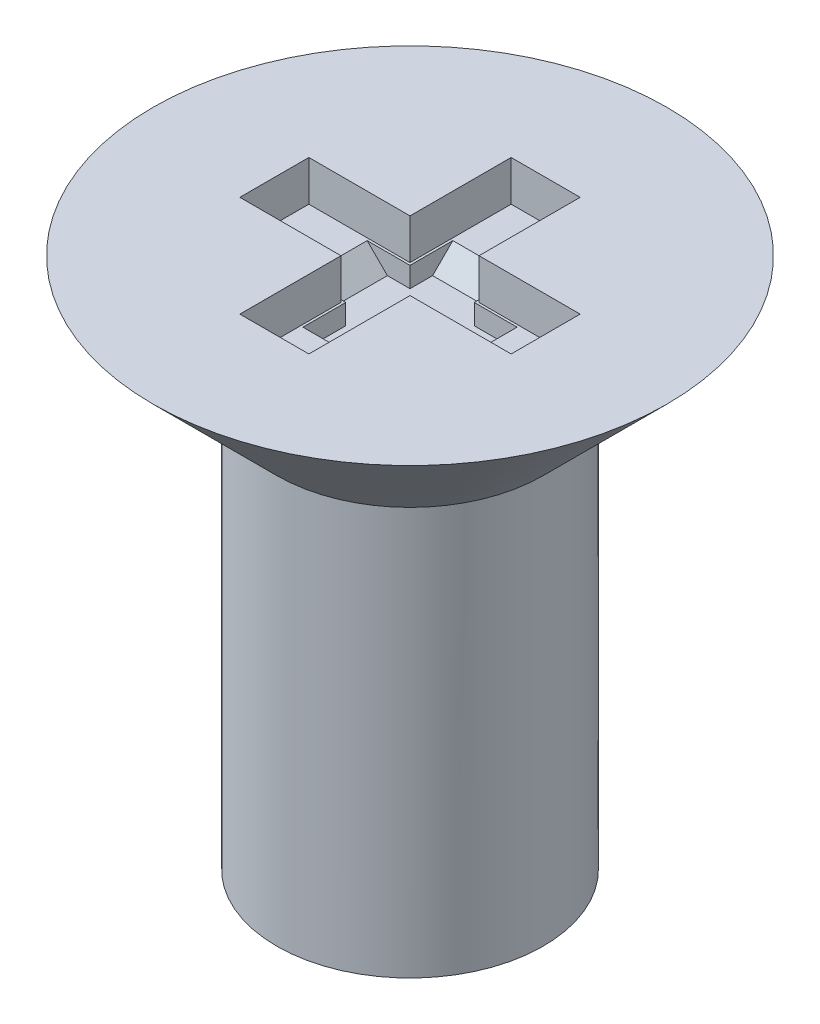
ISO-10303-21;
HEADER;
FILE_DESCRIPTION(('STEP AP214'),'2;1');
FILE_NAME('part.step','',(''),(''),'','','');
FILE_SCHEMA(('AUTOMOTIVE_DESIGN { 1 0 10303 214 1 1 1 1 }'));
ENDSEC;
DATA;
#1=APPLICATION_CONTEXT('core data for automotive mechanical design processes');
#2=APPLICATION_PROTOCOL_DEFINITION('international standard','automotive_design',2000,#1);
#3=PRODUCT_CONTEXT('',#1,'mechanical');
#4=PRODUCT('Part','Part','',(#3));
#5=PRODUCT_RELATED_PRODUCT_CATEGORY('part','',(#4));
#6=PRODUCT_DEFINITION_FORMATION('','',#4);
#7=PRODUCT_DEFINITION_CONTEXT('part definition',#1,'design');
#8=PRODUCT_DEFINITION('design','',#6,#7);
#9=PRODUCT_DEFINITION_SHAPE('','',#8);
#10=(LENGTH_UNIT() NAMED_UNIT(*) SI_UNIT(.MILLI.,.METRE.));
#11=(NAMED_UNIT(*) PLANE_ANGLE_UNIT() SI_UNIT($,.RADIAN.));
#12=(NAMED_UNIT(*) SI_UNIT($,.STERADIAN.) SOLID_ANGLE_UNIT());
#13=UNCERTAINTY_MEASURE_WITH_UNIT(LENGTH_MEASURE(1.E-05),#10,'distance_accuracy_value','');
#14=(GEOMETRIC_REPRESENTATION_CONTEXT(3) GLOBAL_UNCERTAINTY_ASSIGNED_CONTEXT((#13)) GLOBAL_UNIT_ASSIGNED_CONTEXT((#10,
#11,#12)) REPRESENTATION_CONTEXT('',''));
#15=CARTESIAN_POINT('',(0.,0.,0.));
#16=DIRECTION('',(0.,0.,1.));
#17=DIRECTION('',(1.,0.,0.));
#18=AXIS2_PLACEMENT_3D('',#15,#16,#17);
#19=CARTESIAN_POINT('',(-0.58416716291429,0.67306716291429,-0.3429));
#20=DIRECTION('',(0.,-1.,0.));
#21=DIRECTION('',(0.,0.,-1.));
#22=AXIS2_PLACEMENT_3D('',#19,#20,#21);
#23=PLANE('',#22);
#24=DIRECTION('',(1.,0.,0.));
#25=VECTOR('',#24,1.);
#26=CARTESIAN_POINT('',(-0.58416716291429,0.67306716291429,0.3429));
#27=LINE('',#26,#25);
#28=CARTESIAN_POINT('',(-0.58416716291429,0.67306716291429,0.3429));
#29=VERTEX_POINT('',#28);
#30=CARTESIAN_POINT('',(-0.3429,0.67306716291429,0.3429));
#31=VERTEX_POINT('',#30);
#32=EDGE_CURVE('E181',#29,#31,#27,.T.);
#33=ORIENTED_EDGE('',*,*,#32,.T.);
#34=DIRECTION('',(0.,0.,-1.));
#35=VECTOR('',#34,1.);
#36=CARTESIAN_POINT('',(-0.3429,0.67306716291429,0.));
#37=LINE('',#36,#35);
#38=CARTESIAN_POINT('',(-0.3429,0.67306716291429,0.58416716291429));
#39=VERTEX_POINT('',#38);
#40=EDGE_CURVE('E19',#39,#31,#37,.T.);
#41=ORIENTED_EDGE('',*,*,#40,.F.);
#42=DIRECTION('',(1.,0.,0.));
#43=VECTOR('',#42,1.);
#44=CARTESIAN_POINT('',(-0.3429,0.67306716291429,0.58416716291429));
#45=LINE('',#44,#43);
#46=CARTESIAN_POINT('',(0.3429,0.67306716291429,0.58416716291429));
#47=VERTEX_POINT('',#46);
#48=EDGE_CURVE('E178',#39,#47,#45,.T.);
#49=ORIENTED_EDGE('',*,*,#48,.T.);
#50=DIRECTION('',(0.,0.,-1.));
#51=VECTOR('',#50,1.);
#52=CARTESIAN_POINT('',(0.3429,0.67306716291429,-0.3429));
#53=LINE('',#52,#51);
#54=CARTESIAN_POINT('',(0.3429,0.67306716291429,0.3429));
#55=VERTEX_POINT('',#54);
#56=EDGE_CURVE('E193',#47,#55,#53,.T.);
#57=ORIENTED_EDGE('',*,*,#56,.T.);
#58=DIRECTION('',(1.,0.,0.));
#59=VECTOR('',#58,1.);
#60=CARTESIAN_POINT('',(-0.58416716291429,0.67306716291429,0.3429));
#61=LINE('',#60,#59);
#62=CARTESIAN_POINT('',(0.58416716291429,0.67306716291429,0.3429));
#63=VERTEX_POINT('',#62);
#64=EDGE_CURVE('E205',#55,#63,#61,.T.);
#65=ORIENTED_EDGE('',*,*,#64,.T.);
#66=DIRECTION('',(0.,0.,1.));
#67=VECTOR('',#66,1.);
#68=CARTESIAN_POINT('',(0.58416716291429,0.67306716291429,-0.3429));
#69=LINE('',#68,#67);
#70=CARTESIAN_POINT('',(0.58416716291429,0.67306716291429,-0.3429));
#71=VERTEX_POINT('',#70);
#72=EDGE_CURVE('E208',#63,#71,#69,.F.);
#73=ORIENTED_EDGE('',*,*,#72,.T.);
#74=DIRECTION('',(1.,0.,0.));
#75=VECTOR('',#74,1.);
#76=CARTESIAN_POINT('',(0.,0.67306716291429,-0.3429));
#77=LINE('',#76,#75);
#78=CARTESIAN_POINT('',(0.3429,0.67306716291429,-0.3429));
#79=VERTEX_POINT('',#78);
#80=EDGE_CURVE('E209',#79,#71,#77,.T.);
#81=ORIENTED_EDGE('',*,*,#80,.F.);
#82=DIRECTION('',(0.,0.,-1.));
#83=VECTOR('',#82,1.);
#84=CARTESIAN_POINT('',(0.3429,0.67306716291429,-0.3429));
#85=LINE('',#84,#83);
#86=CARTESIAN_POINT('',(0.3429,0.67306716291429,-0.58416716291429));
#87=VERTEX_POINT('',#86);
#88=EDGE_CURVE('E214',#79,#87,#85,.T.);
#89=ORIENTED_EDGE('',*,*,#88,.T.);
#90=DIRECTION('',(-1.,0.,0.));
#91=VECTOR('',#90,1.);
#92=CARTESIAN_POINT('',(-0.3429,0.67306716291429,-0.58416716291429));
#93=LINE('',#92,#91);
#94=CARTESIAN_POINT('',(-0.3429,0.67306716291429,-0.58416716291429));
#95=VERTEX_POINT('',#94);
#96=EDGE_CURVE('E216',#87,#95,#93,.T.);
#97=ORIENTED_EDGE('',*,*,#96,.T.);
#98=DIRECTION('',(0.,0.,-1.));
#99=VECTOR('',#98,1.);
#100=CARTESIAN_POINT('',(-0.3429,0.67306716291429,0.));
#101=LINE('',#100,#99);
#102=CARTESIAN_POINT('',(-0.3429,0.67306716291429,-0.3429));
#103=VERTEX_POINT('',#102);
#104=EDGE_CURVE('E222',#103,#95,#101,.T.);
#105=ORIENTED_EDGE('',*,*,#104,.F.);
#106=DIRECTION('',(1.,0.,0.));
#107=VECTOR('',#106,1.);
#108=CARTESIAN_POINT('',(0.,0.67306716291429,-0.3429));
#109=LINE('',#108,#107);
#110=CARTESIAN_POINT('',(-0.58416716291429,0.67306716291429,-0.3429));
#111=VERTEX_POINT('',#110);
#112=EDGE_CURVE('E224',#111,#103,#109,.T.);
#113=ORIENTED_EDGE('',*,*,#112,.F.);
#114=DIRECTION('',(0.,0.,1.));
#115=VECTOR('',#114,1.);
#116=CARTESIAN_POINT('',(-0.58416716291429,0.67306716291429,-0.3429));
#117=LINE('',#116,#115);
#118=EDGE_CURVE('E227',#111,#29,#117,.T.);
#119=ORIENTED_EDGE('',*,*,#118,.T.);
#120=EDGE_LOOP('',(#33,#41,#49,#57,#65,#73,#81,#89,#97,#105,#113,#119));
#121=FACE_BOUND('',#120,.T.);
#122=ADVANCED_FACE('F16',(#121),#23,.F.);
#123=CARTESIAN_POINT('',(0.,-4.350004,0.));
#124=DIRECTION('',(0.,1.,0.));
#125=DIRECTION('',(0.,0.,1.));
#126=AXIS2_PLACEMENT_3D('',#123,#124,#125);
#127=PLANE('',#126);
#128=CARTESIAN_POINT('',(0.,-4.350004,0.));
#129=DIRECTION('',(0.,1.,0.));
#130=DIRECTION('',(0.,0.,1.));
#131=AXIS2_PLACEMENT_3D('',#128,#129,#130);
#132=CIRCLE('',#131,1.4224);
#133=CARTESIAN_POINT('',(0.,-4.350004,1.4224));
#134=VERTEX_POINT('',#133);
#135=EDGE_CURVE('E199',#134,#134,#132,.T.);
#136=ORIENTED_EDGE('',*,*,#135,.F.);
#137=EDGE_LOOP('',(#136));
#138=FACE_BOUND('',#137,.T.);
#139=ADVANCED_FACE('F552',(#138),#127,.F.);
#140=CARTESIAN_POINT('',(-0.3429,0.,0.));
#141=DIRECTION('',(1.,0.,0.));
#142=DIRECTION('',(0.,0.,-1.));
#143=AXIS2_PLACEMENT_3D('',#140,#141,#142);
#144=PLANE('',#143);
#145=ORIENTED_EDGE('',*,*,#40,.T.);
#146=DIRECTION('',(0.,1.,0.));
#147=VECTOR('',#146,1.);
#148=CARTESIAN_POINT('',(-0.3429,0.,0.3429));
#149=LINE('',#148,#147);
#150=CARTESIAN_POINT('',(-0.3429,0.889,0.3429));
#151=VERTEX_POINT('',#150);
#152=EDGE_CURVE('E184',#31,#151,#149,.T.);
#153=ORIENTED_EDGE('',*,*,#152,.T.);
#154=DIRECTION('',(0.,0.,1.));
#155=VECTOR('',#154,1.);
#156=CARTESIAN_POINT('',(-0.3429,0.889,0.));
#157=LINE('',#156,#155);
#158=CARTESIAN_POINT('',(-0.3429,0.889,0.8001));
#159=VERTEX_POINT('',#158);
#160=EDGE_CURVE('E189',#159,#151,#157,.F.);
#161=ORIENTED_EDGE('',*,*,#160,.F.);
#162=DIRECTION('',(0.,-0.707106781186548,-0.707106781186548));
#163=VECTOR('',#162,1.);
#164=CARTESIAN_POINT('',(-0.3429,0.889,0.8001));
#165=LINE('',#164,#163);
#166=EDGE_CURVE('E186',#159,#39,#165,.T.);
#167=ORIENTED_EDGE('',*,*,#166,.T.);
#168=EDGE_LOOP('',(#145,#153,#161,#167));
#169=FACE_BOUND('',#168,.T.);
#170=ADVANCED_FACE('F187',(#169),#144,.T.);
#171=CARTESIAN_POINT('',(0.,0.,0.3429));
#172=DIRECTION('',(0.,0.,1.));
#173=DIRECTION('',(1.,0.,0.));
#174=AXIS2_PLACEMENT_3D('',#171,#172,#173);
#175=PLANE('',#174);
#176=DIRECTION('',(0.707106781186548,-0.707106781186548,0.));
#177=VECTOR('',#176,1.);
#178=CARTESIAN_POINT('',(-1.2319,1.3208,0.3429));
#179=LINE('',#178,#177);
#180=CARTESIAN_POINT('',(-0.8001,0.889,0.3429));
#181=VERTEX_POINT('',#180);
#182=EDGE_CURVE('E228',#29,#181,#179,.F.);
#183=ORIENTED_EDGE('',*,*,#182,.T.);
#184=DIRECTION('',(1.,0.,0.));
#185=VECTOR('',#184,1.);
#186=CARTESIAN_POINT('',(0.,0.889,0.3429));
#187=LINE('',#186,#185);
#188=EDGE_CURVE('E237',#151,#181,#187,.F.);
#189=ORIENTED_EDGE('',*,*,#188,.F.);
#190=ORIENTED_EDGE('',*,*,#152,.F.);
#191=ORIENTED_EDGE('',*,*,#32,.F.);
#192=EDGE_LOOP('',(#183,#189,#190,#191));
#193=FACE_BOUND('',#192,.T.);
#194=ADVANCED_FACE('F547',(#193),#175,.F.);
#195=CARTESIAN_POINT('',(-1.2319,1.3208,-0.3429));
#196=DIRECTION('',(-0.707106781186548,-0.707106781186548,0.));
#197=DIRECTION('',(0.707106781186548,-0.707106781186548,0.));
#198=AXIS2_PLACEMENT_3D('',#195,#196,#197);
#199=PLANE('',#198);
#200=ORIENTED_EDGE('',*,*,#182,.F.);
#201=ORIENTED_EDGE('',*,*,#118,.F.);
#202=DIRECTION('',(0.707106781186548,-0.707106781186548,0.));
#203=VECTOR('',#202,1.);
#204=CARTESIAN_POINT('',(-0.8001,0.889,-0.3429));
#205=LINE('',#204,#203);
#206=CARTESIAN_POINT('',(-0.8001,0.889,-0.3429));
#207=VERTEX_POINT('',#206);
#208=EDGE_CURVE('E226',#207,#111,#205,.T.);
#209=ORIENTED_EDGE('',*,*,#208,.F.);
#210=DIRECTION('',(0.,0.,1.));
#211=VECTOR('',#210,1.);
#212=CARTESIAN_POINT('',(-0.8001,0.889,0.));
#213=LINE('',#212,#211);
#214=EDGE_CURVE('E240',#181,#207,#213,.F.);
#215=ORIENTED_EDGE('',*,*,#214,.F.);
#216=EDGE_LOOP('',(#200,#201,#209,#215));
#217=FACE_BOUND('',#216,.T.);
#218=ADVANCED_FACE('F314',(#217),#199,.F.);
#219=CARTESIAN_POINT('',(0.,0.,-0.3429));
#220=DIRECTION('',(0.,0.,1.));
#221=DIRECTION('',(1.,0.,0.));
#222=AXIS2_PLACEMENT_3D('',#219,#220,#221);
#223=PLANE('',#222);
#224=ORIENTED_EDGE('',*,*,#112,.T.);
#225=DIRECTION('',(0.,1.,0.));
#226=VECTOR('',#225,1.);
#227=CARTESIAN_POINT('',(-0.3429,0.,-0.3429));
#228=LINE('',#227,#226);
#229=CARTESIAN_POINT('',(-0.3429,0.889,-0.3429));
#230=VERTEX_POINT('',#229);
#231=EDGE_CURVE('E221',#230,#103,#228,.F.);
#232=ORIENTED_EDGE('',*,*,#231,.F.);
#233=DIRECTION('',(1.,0.,0.));
#234=VECTOR('',#233,1.);
#235=CARTESIAN_POINT('',(0.,0.889,-0.3429));
#236=LINE('',#235,#234);
#237=EDGE_CURVE('E294',#207,#230,#236,.T.);
#238=ORIENTED_EDGE('',*,*,#237,.F.);
#239=ORIENTED_EDGE('',*,*,#208,.T.);
#240=EDGE_LOOP('',(#224,#232,#238,#239));
#241=FACE_BOUND('',#240,.T.);
#242=ADVANCED_FACE('F317',(#241),#223,.T.);
#243=CARTESIAN_POINT('',(-0.3429,0.,0.));
#244=DIRECTION('',(1.,0.,0.));
#245=DIRECTION('',(0.,0.,-1.));
#246=AXIS2_PLACEMENT_3D('',#243,#244,#245);
#247=PLANE('',#246);
#248=DIRECTION('',(0.,0.,1.));
#249=VECTOR('',#248,1.);
#250=CARTESIAN_POINT('',(-0.3429,0.889,0.));
#251=LINE('',#250,#249);
#252=CARTESIAN_POINT('',(-0.3429,0.889,-0.8001));
#253=VERTEX_POINT('',#252);
#254=EDGE_CURVE('E291',#230,#253,#251,.F.);
#255=ORIENTED_EDGE('',*,*,#254,.F.);
#256=ORIENTED_EDGE('',*,*,#231,.T.);
#257=ORIENTED_EDGE('',*,*,#104,.T.);
#258=DIRECTION('',(0.,0.707106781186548,-0.707106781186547));
#259=VECTOR('',#258,1.);
#260=CARTESIAN_POINT('',(-0.3429,0.673094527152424,-0.584194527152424));
#261=LINE('',#260,#259);
#262=EDGE_CURVE('E219',#95,#253,#261,.T.);
#263=ORIENTED_EDGE('',*,*,#262,.T.);
#264=EDGE_LOOP('',(#255,#256,#257,#263));
#265=FACE_BOUND('',#264,.T.);
#266=ADVANCED_FACE('F320',(#265),#247,.T.);
#267=CARTESIAN_POINT('',(-0.3429,0.6731,-0.5842));
#268=DIRECTION('',(0.,-0.707106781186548,-0.707106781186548));
#269=DIRECTION('',(0.,0.707106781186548,-0.707106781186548));
#270=AXIS2_PLACEMENT_3D('',#267,#268,#269);
#271=PLANE('',#270);
#272=DIRECTION('',(0.,0.707106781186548,-0.707106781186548));
#273=VECTOR('',#272,1.);
#274=CARTESIAN_POINT('',(0.3429,0.6731,-0.5842));
#275=LINE('',#274,#273);
#276=CARTESIAN_POINT('',(0.3429,0.889,-0.8001));
#277=VERTEX_POINT('',#276);
#278=EDGE_CURVE('E212',#87,#277,#275,.T.);
#279=ORIENTED_EDGE('',*,*,#278,.T.);
#280=DIRECTION('',(1.,0.,0.));
#281=VECTOR('',#280,1.);
#282=CARTESIAN_POINT('',(0.,0.889,-0.8001));
#283=LINE('',#282,#281);
#284=EDGE_CURVE('E288',#253,#277,#283,.T.);
#285=ORIENTED_EDGE('',*,*,#284,.F.);
#286=ORIENTED_EDGE('',*,*,#262,.F.);
#287=ORIENTED_EDGE('',*,*,#96,.F.);
#288=EDGE_LOOP('',(#279,#285,#286,#287));
#289=FACE_BOUND('',#288,.T.);
#290=ADVANCED_FACE('F325',(#289),#271,.F.);
#291=CARTESIAN_POINT('',(0.3429,0.,0.));
#292=DIRECTION('',(1.,0.,0.));
#293=DIRECTION('',(0.,0.,-1.));
#294=AXIS2_PLACEMENT_3D('',#291,#292,#293);
#295=PLANE('',#294);
#296=ORIENTED_EDGE('',*,*,#278,.F.);
#297=ORIENTED_EDGE('',*,*,#88,.F.);
#298=DIRECTION('',(0.,1.,0.));
#299=VECTOR('',#298,1.);
#300=CARTESIAN_POINT('',(0.3429,0.,-0.3429));
#301=LINE('',#300,#299);
#302=CARTESIAN_POINT('',(0.3429,0.889,-0.3429));
#303=VERTEX_POINT('',#302);
#304=EDGE_CURVE('E211',#303,#79,#301,.F.);
#305=ORIENTED_EDGE('',*,*,#304,.F.);
#306=DIRECTION('',(0.,0.,1.));
#307=VECTOR('',#306,1.);
#308=CARTESIAN_POINT('',(0.3429,0.889,0.));
#309=LINE('',#308,#307);
#310=EDGE_CURVE('E281',#277,#303,#309,.T.);
#311=ORIENTED_EDGE('',*,*,#310,.F.);
#312=EDGE_LOOP('',(#296,#297,#305,#311));
#313=FACE_BOUND('',#312,.T.);
#314=ADVANCED_FACE('F330',(#313),#295,.F.);
#315=CARTESIAN_POINT('',(0.,0.,-0.3429));
#316=DIRECTION('',(0.,0.,1.));
#317=DIRECTION('',(1.,0.,0.));
#318=AXIS2_PLACEMENT_3D('',#315,#316,#317);
#319=PLANE('',#318);
#320=DIRECTION('',(1.,0.,0.));
#321=VECTOR('',#320,1.);
#322=CARTESIAN_POINT('',(0.,0.889,-0.3429));
#323=LINE('',#322,#321);
#324=CARTESIAN_POINT('',(0.8001,0.889,-0.3429));
#325=VERTEX_POINT('',#324);
#326=EDGE_CURVE('E276',#303,#325,#323,.T.);
#327=ORIENTED_EDGE('',*,*,#326,.F.);
#328=ORIENTED_EDGE('',*,*,#304,.T.);
#329=ORIENTED_EDGE('',*,*,#80,.T.);
#330=DIRECTION('',(0.707106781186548,0.707106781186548,0.));
#331=VECTOR('',#330,1.);
#332=CARTESIAN_POINT('',(0.58416716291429,0.67306716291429,-0.3429));
#333=LINE('',#332,#331);
#334=EDGE_CURVE('E269',#71,#325,#333,.T.);
#335=ORIENTED_EDGE('',*,*,#334,.T.);
#336=EDGE_LOOP('',(#327,#328,#329,#335));
#337=FACE_BOUND('',#336,.T.);
#338=ADVANCED_FACE('F333',(#337),#319,.T.);
#339=CARTESIAN_POINT('',(0.58416716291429,0.67306716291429,-0.3429));
#340=DIRECTION('',(0.707106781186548,-0.707106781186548,0.));
#341=DIRECTION('',(0.707106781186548,0.707106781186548,0.));
#342=AXIS2_PLACEMENT_3D('',#339,#340,#341);
#343=PLANE('',#342);
#344=DIRECTION('',(0.707106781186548,0.707106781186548,0.));
#345=VECTOR('',#344,1.);
#346=CARTESIAN_POINT('',(0.58416716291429,0.67306716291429,0.3429));
#347=LINE('',#346,#345);
#348=CARTESIAN_POINT('',(0.8001,0.889,0.3429));
#349=VERTEX_POINT('',#348);
#350=EDGE_CURVE('E207',#63,#349,#347,.T.);
#351=ORIENTED_EDGE('',*,*,#350,.T.);
#352=DIRECTION('',(0.,0.,1.));
#353=VECTOR('',#352,1.);
#354=CARTESIAN_POINT('',(0.8001,0.889,0.));
#355=LINE('',#354,#353);
#356=EDGE_CURVE('E264',#325,#349,#355,.T.);
#357=ORIENTED_EDGE('',*,*,#356,.F.);
#358=ORIENTED_EDGE('',*,*,#334,.F.);
#359=ORIENTED_EDGE('',*,*,#72,.F.);
#360=EDGE_LOOP('',(#351,#357,#358,#359));
#361=FACE_BOUND('',#360,.T.);
#362=ADVANCED_FACE('F338',(#361),#343,.F.);
#363=CARTESIAN_POINT('',(0.,0.,0.3429));
#364=DIRECTION('',(0.,0.,1.));
#365=DIRECTION('',(1.,0.,0.));
#366=AXIS2_PLACEMENT_3D('',#363,#364,#365);
#367=PLANE('',#366);
#368=ORIENTED_EDGE('',*,*,#350,.F.);
#369=ORIENTED_EDGE('',*,*,#64,.F.);
#370=DIRECTION('',(0.,1.,0.));
#371=VECTOR('',#370,1.);
#372=CARTESIAN_POINT('',(0.3429,0.,0.3429));
#373=LINE('',#372,#371);
#374=CARTESIAN_POINT('',(0.3429,0.889,0.3429));
#375=VERTEX_POINT('',#374);
#376=EDGE_CURVE('E204',#55,#375,#373,.T.);
#377=ORIENTED_EDGE('',*,*,#376,.T.);
#378=DIRECTION('',(1.,0.,0.));
#379=VECTOR('',#378,1.);
#380=CARTESIAN_POINT('',(0.,0.889,0.3429));
#381=LINE('',#380,#379);
#382=EDGE_CURVE('E260',#349,#375,#381,.F.);
#383=ORIENTED_EDGE('',*,*,#382,.F.);
#384=EDGE_LOOP('',(#368,#369,#377,#383));
#385=FACE_BOUND('',#384,.T.);
#386=ADVANCED_FACE('F342',(#385),#367,.F.);
#387=CARTESIAN_POINT('',(0.3429,0.,0.));
#388=DIRECTION('',(1.,0.,0.));
#389=DIRECTION('',(0.,0.,-1.));
#390=AXIS2_PLACEMENT_3D('',#387,#388,#389);
#391=PLANE('',#390);
#392=DIRECTION('',(0.,0.707106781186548,0.707106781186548));
#393=VECTOR('',#392,1.);
#394=CARTESIAN_POINT('',(0.3429,0.673094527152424,0.584194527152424));
#395=LINE('',#394,#393);
#396=CARTESIAN_POINT('',(0.3429,0.889,0.8001));
#397=VERTEX_POINT('',#396);
#398=EDGE_CURVE('E197',#47,#397,#395,.T.);
#399=ORIENTED_EDGE('',*,*,#398,.T.);
#400=DIRECTION('',(0.,0.,1.));
#401=VECTOR('',#400,1.);
#402=CARTESIAN_POINT('',(0.3429,0.889,0.));
#403=LINE('',#402,#401);
#404=EDGE_CURVE('E263',#375,#397,#403,.T.);
#405=ORIENTED_EDGE('',*,*,#404,.F.);
#406=ORIENTED_EDGE('',*,*,#376,.F.);
#407=ORIENTED_EDGE('',*,*,#56,.F.);
#408=EDGE_LOOP('',(#399,#405,#406,#407));
#409=FACE_BOUND('',#408,.T.);
#410=ADVANCED_FACE('F346',(#409),#391,.F.);
#411=CARTESIAN_POINT('',(-0.3429,1.3208,1.2319));
#412=DIRECTION('',(0.,-0.707106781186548,0.707106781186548));
#413=DIRECTION('',(0.,-0.707106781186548,-0.707106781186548));
#414=AXIS2_PLACEMENT_3D('',#411,#412,#413);
#415=PLANE('',#414);
#416=ORIENTED_EDGE('',*,*,#398,.F.);
#417=ORIENTED_EDGE('',*,*,#48,.F.);
#418=ORIENTED_EDGE('',*,*,#166,.F.);
#419=DIRECTION('',(1.,0.,0.));
#420=VECTOR('',#419,1.);
#421=CARTESIAN_POINT('',(0.,0.889,0.8001));
#422=LINE('',#421,#420);
#423=EDGE_CURVE('E347',#397,#159,#422,.F.);
#424=ORIENTED_EDGE('',*,*,#423,.F.);
#425=EDGE_LOOP('',(#416,#417,#418,#424));
#426=FACE_BOUND('',#425,.T.);
#427=ADVANCED_FACE('F196',(#426),#415,.F.);
#428=CARTESIAN_POINT('',(0.,0.,0.));
#429=DIRECTION('',(0.,1.,0.));
#430=DIRECTION('',(0.,0.,1.));
#431=AXIS2_PLACEMENT_3D('',#428,#429,#430);
#432=CYLINDRICAL_SURFACE('',#431,1.4224);
#433=ORIENTED_EDGE('',*,*,#135,.T.);
#434=EDGE_LOOP('',(#433));
#435=FACE_BOUND('',#434,.T.);
#436=CARTESIAN_POINT('',(0.,0.,0.));
#437=DIRECTION('',(0.,1.,0.));
#438=DIRECTION('',(1.,0.,0.));
#439=AXIS2_PLACEMENT_3D('',#436,#437,#438);
#440=CIRCLE('',#439,1.42239999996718);
#441=CARTESIAN_POINT('',(1.42239999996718,0.,0.));
#442=VERTEX_POINT('',#441);
#443=EDGE_CURVE('E348',#442,#442,#440,.T.);
#444=ORIENTED_EDGE('',*,*,#443,.F.);
#445=EDGE_LOOP('',(#444));
#446=FACE_BOUND('',#445,.T.);
#447=ADVANCED_FACE('F524',(#435,#446),#432,.T.);
#448=CARTESIAN_POINT('',(0.,0.889,0.));
#449=DIRECTION('',(0.,1.,0.));
#450=DIRECTION('',(0.,0.,1.));
#451=AXIS2_PLACEMENT_3D('',#448,#449,#450);
#452=PLANE('',#451);
#453=ORIENTED_EDGE('',*,*,#404,.T.);
#454=ORIENTED_EDGE('',*,*,#423,.T.);
#455=ORIENTED_EDGE('',*,*,#160,.T.);
#456=ORIENTED_EDGE('',*,*,#188,.T.);
#457=ORIENTED_EDGE('',*,*,#214,.T.);
#458=ORIENTED_EDGE('',*,*,#237,.T.);
#459=ORIENTED_EDGE('',*,*,#254,.T.);
#460=ORIENTED_EDGE('',*,*,#284,.T.);
#461=ORIENTED_EDGE('',*,*,#310,.T.);
#462=ORIENTED_EDGE('',*,*,#326,.T.);
#463=ORIENTED_EDGE('',*,*,#356,.T.);
#464=ORIENTED_EDGE('',*,*,#382,.T.);
#465=EDGE_LOOP('',(#453,#454,#455,#456,#457,#458,#459,#460,#461,#462,#463,#464));
#466=FACE_BOUND('',#465,.T.);
#467=DIRECTION('',(-1.,0.,0.));
#468=VECTOR('',#467,1.);
#469=CARTESIAN_POINT('',(0.3683,0.889,-1.4478));
#470=LINE('',#469,#468);
#471=CARTESIAN_POINT('',(0.3683,0.889,-1.4478));
#472=VERTEX_POINT('',#471);
#473=CARTESIAN_POINT('',(-0.3683,0.889,-1.4478));
#474=VERTEX_POINT('',#473);
#475=EDGE_CURVE('E353',#472,#474,#470,.T.);
#476=ORIENTED_EDGE('',*,*,#475,.T.);
#477=DIRECTION('',(0.,0.,1.));
#478=VECTOR('',#477,1.);
#479=CARTESIAN_POINT('',(-0.3683,0.889,-1.4478));
#480=LINE('',#479,#478);
#481=CARTESIAN_POINT('',(-0.3683,0.889,-0.3683));
#482=VERTEX_POINT('',#481);
#483=EDGE_CURVE('E398',#474,#482,#480,.T.);
#484=ORIENTED_EDGE('',*,*,#483,.T.);
#485=DIRECTION('',(-1.,0.,0.));
#486=VECTOR('',#485,1.);
#487=CARTESIAN_POINT('',(-0.3683,0.889,-0.3683));
#488=LINE('',#487,#486);
#489=CARTESIAN_POINT('',(-1.4478,0.889,-0.3683));
#490=VERTEX_POINT('',#489);
#491=EDGE_CURVE('E391',#482,#490,#488,.T.);
#492=ORIENTED_EDGE('',*,*,#491,.T.);
#493=DIRECTION('',(0.,0.,1.));
#494=VECTOR('',#493,1.);
#495=CARTESIAN_POINT('',(-1.4478,0.889,-0.3683));
#496=LINE('',#495,#494);
#497=CARTESIAN_POINT('',(-1.4478,0.889,0.3683));
#498=VERTEX_POINT('',#497);
#499=EDGE_CURVE('E387',#490,#498,#496,.T.);
#500=ORIENTED_EDGE('',*,*,#499,.T.);
#501=DIRECTION('',(1.,0.,0.));
#502=VECTOR('',#501,1.);
#503=CARTESIAN_POINT('',(-1.4478,0.889,0.3683));
#504=LINE('',#503,#502);
#505=CARTESIAN_POINT('',(-0.3683,0.889,0.3683));
#506=VERTEX_POINT('',#505);
#507=EDGE_CURVE('E383',#498,#506,#504,.T.);
#508=ORIENTED_EDGE('',*,*,#507,.T.);
#509=DIRECTION('',(0.,0.,1.));
#510=VECTOR('',#509,1.);
#511=CARTESIAN_POINT('',(-0.3683,0.889,0.3683));
#512=LINE('',#511,#510);
#513=CARTESIAN_POINT('',(-0.3683,0.889,1.4478));
#514=VERTEX_POINT('',#513);
#515=EDGE_CURVE('E379',#506,#514,#512,.T.);
#516=ORIENTED_EDGE('',*,*,#515,.T.);
#517=DIRECTION('',(1.,0.,0.));
#518=VECTOR('',#517,1.);
#519=CARTESIAN_POINT('',(-0.3683,0.889,1.4478));
#520=LINE('',#519,#518);
#521=CARTESIAN_POINT('',(0.3683,0.889,1.4478));
#522=VERTEX_POINT('',#521);
#523=EDGE_CURVE('E375',#514,#522,#520,.T.);
#524=ORIENTED_EDGE('',*,*,#523,.T.);
#525=DIRECTION('',(0.,0.,-1.));
#526=VECTOR('',#525,1.);
#527=CARTESIAN_POINT('',(0.3683,0.889,1.4478));
#528=LINE('',#527,#526);
#529=CARTESIAN_POINT('',(0.3683,0.889,0.3683));
#530=VERTEX_POINT('',#529);
#531=EDGE_CURVE('E371',#522,#530,#528,.T.);
#532=ORIENTED_EDGE('',*,*,#531,.T.);
#533=DIRECTION('',(1.,0.,0.));
#534=VECTOR('',#533,1.);
#535=CARTESIAN_POINT('',(0.3683,0.889,0.3683));
#536=LINE('',#535,#534);
#537=CARTESIAN_POINT('',(1.4478,0.889,0.3683));
#538=VERTEX_POINT('',#537);
#539=EDGE_CURVE('E367',#530,#538,#536,.T.);
#540=ORIENTED_EDGE('',*,*,#539,.T.);
#541=DIRECTION('',(0.,0.,-1.));
#542=VECTOR('',#541,1.);
#543=CARTESIAN_POINT('',(1.4478,0.889,0.3683));
#544=LINE('',#543,#542);
#545=CARTESIAN_POINT('',(1.4478,0.889,-0.3683));
#546=VERTEX_POINT('',#545);
#547=EDGE_CURVE('E363',#538,#546,#544,.T.);
#548=ORIENTED_EDGE('',*,*,#547,.T.);
#549=DIRECTION('',(-1.,0.,0.));
#550=VECTOR('',#549,1.);
#551=CARTESIAN_POINT('',(1.4478,0.889,-0.3683));
#552=LINE('',#551,#550);
#553=CARTESIAN_POINT('',(0.3683,0.889,-0.3683));
#554=VERTEX_POINT('',#553);
#555=EDGE_CURVE('E359',#546,#554,#552,.T.);
#556=ORIENTED_EDGE('',*,*,#555,.T.);
#557=DIRECTION('',(0.,0.,-1.));
#558=VECTOR('',#557,1.);
#559=CARTESIAN_POINT('',(0.3683,0.889,-0.3683));
#560=LINE('',#559,#558);
#561=EDGE_CURVE('E355',#554,#472,#560,.T.);
#562=ORIENTED_EDGE('',*,*,#561,.T.);
#563=EDGE_LOOP('',(#476,#484,#492,#500,#508,#516,#524,#532,#540,#548,#556,#562));
#564=FACE_BOUND('',#563,.T.);
#565=ADVANCED_FACE('F309',(#466,#564),#452,.T.);
#566=CARTESIAN_POINT('',(0.,1.32079999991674,0.));
#567=DIRECTION('',(0.,1.,0.));
#568=DIRECTION('',(0.,0.,1.));
#569=AXIS2_PLACEMENT_3D('',#566,#567,#568);
#570=CONICAL_SURFACE('',#569,2.74319999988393,0.785398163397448);
#571=CARTESIAN_POINT('',(0.,1.32080000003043,0.));
#572=DIRECTION('',(0.,1.,0.));
#573=DIRECTION('',(0.,0.,1.));
#574=AXIS2_PLACEMENT_3D('',#571,#572,#573);
#575=CIRCLE('',#574,2.74319999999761);
#576=CARTESIAN_POINT('',(0.,1.32080000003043,2.74319999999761));
#577=VERTEX_POINT('',#576);
#578=EDGE_CURVE('E243',#577,#577,#575,.T.);
#579=ORIENTED_EDGE('',*,*,#578,.F.);
#580=EDGE_LOOP('',(#579));
#581=FACE_BOUND('',#580,.T.);
#582=ORIENTED_EDGE('',*,*,#443,.T.);
#583=EDGE_LOOP('',(#582));
#584=FACE_BOUND('',#583,.T.);
#585=ADVANCED_FACE('F518',(#581,#584),#570,.T.);
#586=CARTESIAN_POINT('',(0.3683,2.921,-1.4478));
#587=DIRECTION('',(0.,0.,-1.));
#588=DIRECTION('',(-1.,0.,0.));
#589=AXIS2_PLACEMENT_3D('',#586,#587,#588);
#590=PLANE('',#589);
#591=ORIENTED_EDGE('',*,*,#475,.F.);
#592=DIRECTION('',(0.,1.,0.));
#593=VECTOR('',#592,1.);
#594=CARTESIAN_POINT('',(0.3683,2.921,-1.4478));
#595=LINE('',#594,#593);
#596=CARTESIAN_POINT('',(0.3683,1.3208,-1.4478));
#597=VERTEX_POINT('',#596);
#598=EDGE_CURVE('E357',#472,#597,#595,.T.);
#599=ORIENTED_EDGE('',*,*,#598,.T.);
#600=DIRECTION('',(1.,0.,0.));
#601=VECTOR('',#600,1.);
#602=CARTESIAN_POINT('',(0.,1.3208,-1.4478));
#603=LINE('',#602,#601);
#604=CARTESIAN_POINT('',(-0.3683,1.3208,-1.4478));
#605=VERTEX_POINT('',#604);
#606=EDGE_CURVE('E245',#605,#597,#603,.T.);
#607=ORIENTED_EDGE('',*,*,#606,.F.);
#608=DIRECTION('',(0.,1.,0.));
#609=VECTOR('',#608,1.);
#610=CARTESIAN_POINT('',(-0.3683,2.921,-1.4478));
#611=LINE('',#610,#609);
#612=EDGE_CURVE('E395',#605,#474,#611,.F.);
#613=ORIENTED_EDGE('',*,*,#612,.T.);
#614=EDGE_LOOP('',(#591,#599,#607,#613));
#615=FACE_BOUND('',#614,.T.);
#616=ADVANCED_FACE('F483',(#615),#590,.F.);
#617=CARTESIAN_POINT('',(0.3683,2.921,-0.3683));
#618=DIRECTION('',(1.,0.,0.));
#619=DIRECTION('',(0.,0.,-1.));
#620=AXIS2_PLACEMENT_3D('',#617,#618,#619);
#621=PLANE('',#620);
#622=ORIENTED_EDGE('',*,*,#561,.F.);
#623=DIRECTION('',(0.,1.,0.));
#624=VECTOR('',#623,1.);
#625=CARTESIAN_POINT('',(0.3683,2.921,-0.3683));
#626=LINE('',#625,#624);
#627=CARTESIAN_POINT('',(0.3683,1.3208,-0.3683));
#628=VERTEX_POINT('',#627);
#629=EDGE_CURVE('E361',#554,#628,#626,.T.);
#630=ORIENTED_EDGE('',*,*,#629,.T.);
#631=DIRECTION('',(0.,0.,1.));
#632=VECTOR('',#631,1.);
#633=CARTESIAN_POINT('',(0.3683,1.3208,0.));
#634=LINE('',#633,#632);
#635=EDGE_CURVE('E403',#597,#628,#634,.T.);
#636=ORIENTED_EDGE('',*,*,#635,.F.);
#637=ORIENTED_EDGE('',*,*,#598,.F.);
#638=EDGE_LOOP('',(#622,#630,#636,#637));
#639=FACE_BOUND('',#638,.T.);
#640=ADVANCED_FACE('F479',(#639),#621,.F.);
#641=CARTESIAN_POINT('',(1.4478,2.921,-0.3683));
#642=DIRECTION('',(0.,0.,-1.));
#643=DIRECTION('',(-1.,0.,0.));
#644=AXIS2_PLACEMENT_3D('',#641,#642,#643);
#645=PLANE('',#644);
#646=ORIENTED_EDGE('',*,*,#555,.F.);
#647=DIRECTION('',(0.,1.,0.));
#648=VECTOR('',#647,1.);
#649=CARTESIAN_POINT('',(1.4478,2.921,-0.3683));
#650=LINE('',#649,#648);
#651=CARTESIAN_POINT('',(1.4478,1.3208,-0.3683));
#652=VERTEX_POINT('',#651);
#653=EDGE_CURVE('E365',#546,#652,#650,.T.);
#654=ORIENTED_EDGE('',*,*,#653,.T.);
#655=DIRECTION('',(1.,0.,0.));
#656=VECTOR('',#655,1.);
#657=CARTESIAN_POINT('',(0.,1.3208,-0.3683));
#658=LINE('',#657,#656);
#659=EDGE_CURVE('E406',#628,#652,#658,.T.);
#660=ORIENTED_EDGE('',*,*,#659,.F.);
#661=ORIENTED_EDGE('',*,*,#629,.F.);
#662=EDGE_LOOP('',(#646,#654,#660,#661));
#663=FACE_BOUND('',#662,.T.);
#664=ADVANCED_FACE('F475',(#663),#645,.F.);
#665=CARTESIAN_POINT('',(1.4478,2.921,0.3683));
#666=DIRECTION('',(1.,0.,0.));
#667=DIRECTION('',(0.,0.,-1.));
#668=AXIS2_PLACEMENT_3D('',#665,#666,#667);
#669=PLANE('',#668);
#670=ORIENTED_EDGE('',*,*,#547,.F.);
#671=DIRECTION('',(0.,1.,0.));
#672=VECTOR('',#671,1.);
#673=CARTESIAN_POINT('',(1.4478,2.921,0.3683));
#674=LINE('',#673,#672);
#675=CARTESIAN_POINT('',(1.4478,1.3208,0.3683));
#676=VERTEX_POINT('',#675);
#677=EDGE_CURVE('E369',#538,#676,#674,.T.);
#678=ORIENTED_EDGE('',*,*,#677,.T.);
#679=DIRECTION('',(0.,0.,1.));
#680=VECTOR('',#679,1.);
#681=CARTESIAN_POINT('',(1.4478,1.3208,0.));
#682=LINE('',#681,#680);
#683=EDGE_CURVE('E409',#652,#676,#682,.T.);
#684=ORIENTED_EDGE('',*,*,#683,.F.);
#685=ORIENTED_EDGE('',*,*,#653,.F.);
#686=EDGE_LOOP('',(#670,#678,#684,#685));
#687=FACE_BOUND('',#686,.T.);
#688=ADVANCED_FACE('F469',(#687),#669,.F.);
#689=CARTESIAN_POINT('',(0.3683,2.921,0.3683));
#690=DIRECTION('',(0.,0.,1.));
#691=DIRECTION('',(1.,0.,0.));
#692=AXIS2_PLACEMENT_3D('',#689,#690,#691);
#693=PLANE('',#692);
#694=ORIENTED_EDGE('',*,*,#539,.F.);
#695=DIRECTION('',(0.,1.,0.));
#696=VECTOR('',#695,1.);
#697=CARTESIAN_POINT('',(0.3683,2.921,0.3683));
#698=LINE('',#697,#696);
#699=CARTESIAN_POINT('',(0.3683,1.3208,0.3683));
#700=VERTEX_POINT('',#699);
#701=EDGE_CURVE('E373',#530,#700,#698,.T.);
#702=ORIENTED_EDGE('',*,*,#701,.T.);
#703=DIRECTION('',(1.,0.,0.));
#704=VECTOR('',#703,1.);
#705=CARTESIAN_POINT('',(0.,1.3208,0.3683));
#706=LINE('',#705,#704);
#707=EDGE_CURVE('E412',#676,#700,#706,.F.);
#708=ORIENTED_EDGE('',*,*,#707,.F.);
#709=ORIENTED_EDGE('',*,*,#677,.F.);
#710=EDGE_LOOP('',(#694,#702,#708,#709));
#711=FACE_BOUND('',#710,.T.);
#712=ADVANCED_FACE('F465',(#711),#693,.F.);
#713=CARTESIAN_POINT('',(0.3683,2.921,1.4478));
#714=DIRECTION('',(1.,0.,0.));
#715=DIRECTION('',(0.,0.,-1.));
#716=AXIS2_PLACEMENT_3D('',#713,#714,#715);
#717=PLANE('',#716);
#718=ORIENTED_EDGE('',*,*,#531,.F.);
#719=DIRECTION('',(0.,1.,0.));
#720=VECTOR('',#719,1.);
#721=CARTESIAN_POINT('',(0.3683,2.921,1.4478));
#722=LINE('',#721,#720);
#723=CARTESIAN_POINT('',(0.3683,1.3208,1.4478));
#724=VERTEX_POINT('',#723);
#725=EDGE_CURVE('E377',#522,#724,#722,.T.);
#726=ORIENTED_EDGE('',*,*,#725,.T.);
#727=DIRECTION('',(0.,0.,1.));
#728=VECTOR('',#727,1.);
#729=CARTESIAN_POINT('',(0.3683,1.3208,0.));
#730=LINE('',#729,#728);
#731=EDGE_CURVE('E415',#700,#724,#730,.T.);
#732=ORIENTED_EDGE('',*,*,#731,.F.);
#733=ORIENTED_EDGE('',*,*,#701,.F.);
#734=EDGE_LOOP('',(#718,#726,#732,#733));
#735=FACE_BOUND('',#734,.T.);
#736=ADVANCED_FACE('F459',(#735),#717,.F.);
#737=CARTESIAN_POINT('',(-0.3683,2.921,1.4478));
#738=DIRECTION('',(0.,0.,1.));
#739=DIRECTION('',(1.,0.,0.));
#740=AXIS2_PLACEMENT_3D('',#737,#738,#739);
#741=PLANE('',#740);
#742=ORIENTED_EDGE('',*,*,#523,.F.);
#743=DIRECTION('',(0.,1.,0.));
#744=VECTOR('',#743,1.);
#745=CARTESIAN_POINT('',(-0.3683,2.921,1.4478));
#746=LINE('',#745,#744);
#747=CARTESIAN_POINT('',(-0.3683,1.3208,1.4478));
#748=VERTEX_POINT('',#747);
#749=EDGE_CURVE('E381',#514,#748,#746,.T.);
#750=ORIENTED_EDGE('',*,*,#749,.T.);
#751=DIRECTION('',(1.,0.,0.));
#752=VECTOR('',#751,1.);
#753=CARTESIAN_POINT('',(0.,1.3208,1.4478));
#754=LINE('',#753,#752);
#755=EDGE_CURVE('E418',#724,#748,#754,.F.);
#756=ORIENTED_EDGE('',*,*,#755,.F.);
#757=ORIENTED_EDGE('',*,*,#725,.F.);
#758=EDGE_LOOP('',(#742,#750,#756,#757));
#759=FACE_BOUND('',#758,.T.);
#760=ADVANCED_FACE('F455',(#759),#741,.F.);
#761=CARTESIAN_POINT('',(-0.3683,2.921,0.3683));
#762=DIRECTION('',(-1.,0.,0.));
#763=DIRECTION('',(0.,0.,1.));
#764=AXIS2_PLACEMENT_3D('',#761,#762,#763);
#765=PLANE('',#764);
#766=ORIENTED_EDGE('',*,*,#515,.F.);
#767=DIRECTION('',(0.,1.,0.));
#768=VECTOR('',#767,1.);
#769=CARTESIAN_POINT('',(-0.3683,2.921,0.3683));
#770=LINE('',#769,#768);
#771=CARTESIAN_POINT('',(-0.3683,1.3208,0.3683));
#772=VERTEX_POINT('',#771);
#773=EDGE_CURVE('E385',#506,#772,#770,.T.);
#774=ORIENTED_EDGE('',*,*,#773,.T.);
#775=DIRECTION('',(0.,0.,1.));
#776=VECTOR('',#775,1.);
#777=CARTESIAN_POINT('',(-0.3683,1.3208,0.));
#778=LINE('',#777,#776);
#779=EDGE_CURVE('E421',#748,#772,#778,.F.);
#780=ORIENTED_EDGE('',*,*,#779,.F.);
#781=ORIENTED_EDGE('',*,*,#749,.F.);
#782=EDGE_LOOP('',(#766,#774,#780,#781));
#783=FACE_BOUND('',#782,.T.);
#784=ADVANCED_FACE('F449',(#783),#765,.F.);
#785=CARTESIAN_POINT('',(-1.4478,2.921,0.3683));
#786=DIRECTION('',(0.,0.,1.));
#787=DIRECTION('',(1.,0.,0.));
#788=AXIS2_PLACEMENT_3D('',#785,#786,#787);
#789=PLANE('',#788);
#790=ORIENTED_EDGE('',*,*,#507,.F.);
#791=DIRECTION('',(0.,1.,0.));
#792=VECTOR('',#791,1.);
#793=CARTESIAN_POINT('',(-1.4478,2.921,0.3683));
#794=LINE('',#793,#792);
#795=CARTESIAN_POINT('',(-1.4478,1.3208,0.3683));
#796=VERTEX_POINT('',#795);
#797=EDGE_CURVE('E389',#498,#796,#794,.T.);
#798=ORIENTED_EDGE('',*,*,#797,.T.);
#799=DIRECTION('',(1.,0.,0.));
#800=VECTOR('',#799,1.);
#801=CARTESIAN_POINT('',(0.,1.3208,0.3683));
#802=LINE('',#801,#800);
#803=EDGE_CURVE('E424',#772,#796,#802,.F.);
#804=ORIENTED_EDGE('',*,*,#803,.F.);
#805=ORIENTED_EDGE('',*,*,#773,.F.);
#806=EDGE_LOOP('',(#790,#798,#804,#805));
#807=FACE_BOUND('',#806,.T.);
#808=ADVANCED_FACE('F445',(#807),#789,.F.);
#809=CARTESIAN_POINT('',(-1.4478,2.921,-0.3683));
#810=DIRECTION('',(-1.,0.,0.));
#811=DIRECTION('',(0.,0.,1.));
#812=AXIS2_PLACEMENT_3D('',#809,#810,#811);
#813=PLANE('',#812);
#814=ORIENTED_EDGE('',*,*,#499,.F.);
#815=DIRECTION('',(0.,1.,0.));
#816=VECTOR('',#815,1.);
#817=CARTESIAN_POINT('',(-1.4478,2.921,-0.3683));
#818=LINE('',#817,#816);
#819=CARTESIAN_POINT('',(-1.4478,1.3208,-0.3683));
#820=VERTEX_POINT('',#819);
#821=EDGE_CURVE('E393',#490,#820,#818,.T.);
#822=ORIENTED_EDGE('',*,*,#821,.T.);
#823=DIRECTION('',(0.,0.,1.));
#824=VECTOR('',#823,1.);
#825=CARTESIAN_POINT('',(-1.4478,1.3208,0.));
#826=LINE('',#825,#824);
#827=EDGE_CURVE('E427',#796,#820,#826,.F.);
#828=ORIENTED_EDGE('',*,*,#827,.F.);
#829=ORIENTED_EDGE('',*,*,#797,.F.);
#830=EDGE_LOOP('',(#814,#822,#828,#829));
#831=FACE_BOUND('',#830,.T.);
#832=ADVANCED_FACE('F439',(#831),#813,.F.);
#833=CARTESIAN_POINT('',(-0.3683,2.921,-0.3683));
#834=DIRECTION('',(0.,0.,-1.));
#835=DIRECTION('',(-1.,0.,0.));
#836=AXIS2_PLACEMENT_3D('',#833,#834,#835);
#837=PLANE('',#836);
#838=ORIENTED_EDGE('',*,*,#491,.F.);
#839=DIRECTION('',(0.,1.,0.));
#840=VECTOR('',#839,1.);
#841=CARTESIAN_POINT('',(-0.3683,2.921,-0.3683));
#842=LINE('',#841,#840);
#843=CARTESIAN_POINT('',(-0.3683,1.3208,-0.3683));
#844=VERTEX_POINT('',#843);
#845=EDGE_CURVE('E34',#482,#844,#842,.T.);
#846=ORIENTED_EDGE('',*,*,#845,.T.);
#847=DIRECTION('',(1.,0.,0.));
#848=VECTOR('',#847,1.);
#849=CARTESIAN_POINT('',(0.,1.3208,-0.3683));
#850=LINE('',#849,#848);
#851=EDGE_CURVE('E25',#820,#844,#850,.T.);
#852=ORIENTED_EDGE('',*,*,#851,.F.);
#853=ORIENTED_EDGE('',*,*,#821,.F.);
#854=EDGE_LOOP('',(#838,#846,#852,#853));
#855=FACE_BOUND('',#854,.T.);
#856=ADVANCED_FACE('F436',(#855),#837,.F.);
#857=CARTESIAN_POINT('',(-0.3683,2.921,-1.4478));
#858=DIRECTION('',(-1.,0.,0.));
#859=DIRECTION('',(0.,0.,1.));
#860=AXIS2_PLACEMENT_3D('',#857,#858,#859);
#861=PLANE('',#860);
#862=ORIENTED_EDGE('',*,*,#483,.F.);
#863=ORIENTED_EDGE('',*,*,#612,.F.);
#864=DIRECTION('',(0.,0.,1.));
#865=VECTOR('',#864,1.);
#866=CARTESIAN_POINT('',(-0.3683,1.3208,0.));
#867=LINE('',#866,#865);
#868=EDGE_CURVE('E11',#844,#605,#867,.F.);
#869=ORIENTED_EDGE('',*,*,#868,.F.);
#870=ORIENTED_EDGE('',*,*,#845,.F.);
#871=EDGE_LOOP('',(#862,#863,#869,#870));
#872=FACE_BOUND('',#871,.T.);
#873=ADVANCED_FACE('F487',(#872),#861,.F.);
#874=CARTESIAN_POINT('',(0.,1.3208,0.));
#875=DIRECTION('',(0.,1.,0.));
#876=DIRECTION('',(0.,0.,1.));
#877=AXIS2_PLACEMENT_3D('',#874,#875,#876);
#878=PLANE('',#877);
#879=ORIENTED_EDGE('',*,*,#851,.T.);
#880=ORIENTED_EDGE('',*,*,#868,.T.);
#881=ORIENTED_EDGE('',*,*,#606,.T.);
#882=ORIENTED_EDGE('',*,*,#635,.T.);
#883=ORIENTED_EDGE('',*,*,#659,.T.);
#884=ORIENTED_EDGE('',*,*,#683,.T.);
#885=ORIENTED_EDGE('',*,*,#707,.T.);
#886=ORIENTED_EDGE('',*,*,#731,.T.);
#887=ORIENTED_EDGE('',*,*,#755,.T.);
#888=ORIENTED_EDGE('',*,*,#779,.T.);
#889=ORIENTED_EDGE('',*,*,#803,.T.);
#890=ORIENTED_EDGE('',*,*,#827,.T.);
#891=EDGE_LOOP('',(#879,#880,#881,#882,#883,#884,#885,#886,#887,#888,#889,#890));
#892=FACE_BOUND('',#891,.T.);
#893=ORIENTED_EDGE('',*,*,#578,.T.);
#894=EDGE_LOOP('',(#893));
#895=FACE_BOUND('',#894,.T.);
#896=ADVANCED_FACE('F432',(#892,#895),#878,.T.);
#897=CLOSED_SHELL('',(#122,#139,#170,#194,#218,#242,#266,#290,#314,#338,#362,#386,#410,#427,
#447,#565,#585,#616,#640,#664,#688,#712,#736,#760,#784,#808,#832,#856,#873,#896));
#898=MANIFOLD_SOLID_BREP('B1',#897);
#899=ADVANCED_BREP_SHAPE_REPRESENTATION('',(#18,#898),#14);
#900=SHAPE_DEFINITION_REPRESENTATION(#9,#899);
ENDSEC;
END-ISO-10303-21;
